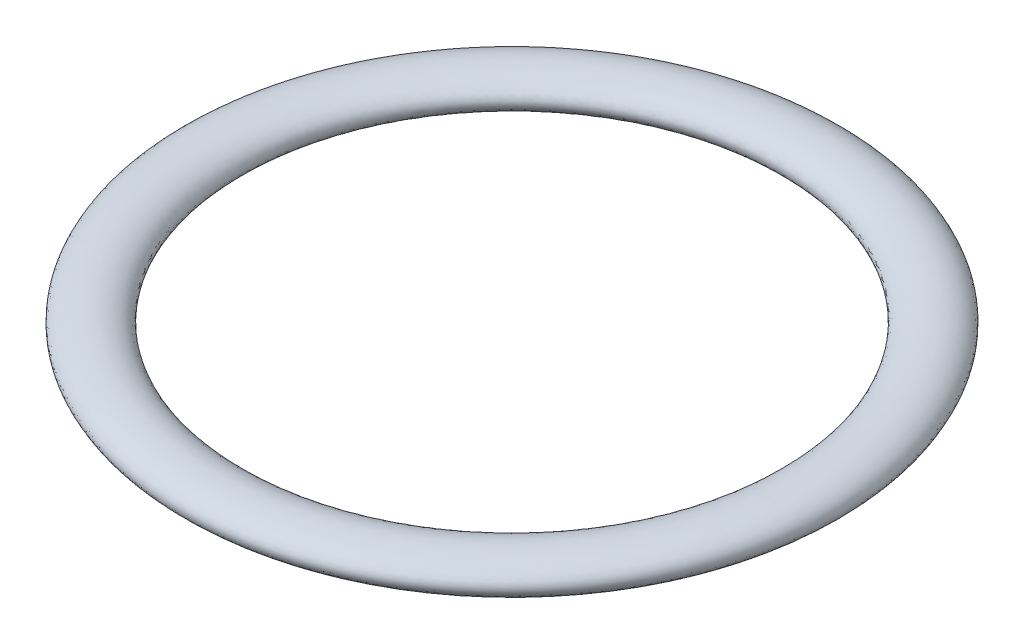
ISO-10303-21;
HEADER;
FILE_DESCRIPTION(('STEP AP214'),'2;1');
FILE_NAME('part.step','',(''),(''),'','','');
FILE_SCHEMA(('AUTOMOTIVE_DESIGN { 1 0 10303 214 1 1 1 1 }'));
ENDSEC;
DATA;
#1=APPLICATION_CONTEXT('core data for automotive mechanical design processes');
#2=APPLICATION_PROTOCOL_DEFINITION('international standard','automotive_design',2000,#1);
#3=PRODUCT_CONTEXT('',#1,'mechanical');
#4=PRODUCT('Part','Part','',(#3));
#5=PRODUCT_RELATED_PRODUCT_CATEGORY('part','',(#4));
#6=PRODUCT_DEFINITION_FORMATION('','',#4);
#7=PRODUCT_DEFINITION_CONTEXT('part definition',#1,'design');
#8=PRODUCT_DEFINITION('design','',#6,#7);
#9=PRODUCT_DEFINITION_SHAPE('','',#8);
#10=(LENGTH_UNIT() NAMED_UNIT(*) SI_UNIT(.MILLI.,.METRE.));
#11=(NAMED_UNIT(*) PLANE_ANGLE_UNIT() SI_UNIT($,.RADIAN.));
#12=(NAMED_UNIT(*) SI_UNIT($,.STERADIAN.) SOLID_ANGLE_UNIT());
#13=UNCERTAINTY_MEASURE_WITH_UNIT(LENGTH_MEASURE(1.E-05),#10,'distance_accuracy_value','');
#14=(GEOMETRIC_REPRESENTATION_CONTEXT(3) GLOBAL_UNCERTAINTY_ASSIGNED_CONTEXT((#13)) GLOBAL_UNIT_ASSIGNED_CONTEXT((#10,
#11,#12)) REPRESENTATION_CONTEXT('',''));
#15=CARTESIAN_POINT('',(0.,0.,0.));
#16=DIRECTION('',(0.,0.,1.));
#17=DIRECTION('',(1.,0.,0.));
#18=AXIS2_PLACEMENT_3D('',#15,#16,#17);
#19=CARTESIAN_POINT('',(12.925,-9.725,0.));
#20=DIRECTION('',(0.,0.,1.));
#21=DIRECTION('',(1.,0.,0.));
#22=AXIS2_PLACEMENT_3D('',#19,#20,#21);
#23=ELLIPSE('',#22,1.379310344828,0.725);
#24=CARTESIAN_POINT('',(0.,0.,0.));
#25=DIRECTION('',(0.,-1.,0.));
#26=AXIS1_PLACEMENT('',#24,#25);
#27=SURFACE_OF_REVOLUTION('',#23,#26);
#28=CARTESIAN_POINT('',(12.925,-9.725,0.));
#29=DIRECTION('',(0.,0.,1.));
#30=DIRECTION('',(1.,0.,0.));
#31=AXIS2_PLACEMENT_3D('',#28,#29,#30);
#32=ELLIPSE('',#31,1.379310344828,0.725);
#33=CARTESIAN_POINT('',(14.304310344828,-9.725,0.));
#34=VERTEX_POINT('',#33);
#35=EDGE_CURVE('E23',#34,#34,#32,.T.);
#36=ORIENTED_EDGE('',*,*,#35,.F.);
#37=CARTESIAN_POINT('',(0.,-9.725,0.));
#38=DIRECTION('',(0.,1.,0.));
#39=DIRECTION('',(1.,0.,0.));
#40=AXIS2_PLACEMENT_3D('',#37,#38,#39);
#41=CIRCLE('',#40,14.304310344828);
#42=EDGE_CURVE('E10',#34,#34,#41,.T.);
#43=ORIENTED_EDGE('',*,*,#42,.T.);
#44=ORIENTED_EDGE('',*,*,#35,.T.);
#45=ORIENTED_EDGE('',*,*,#42,.F.);
#46=EDGE_LOOP('',(#36,#43,#44,#45));
#47=FACE_BOUND('',#46,.T.);
#48=ADVANCED_FACE('F16',(#47),#27,.F.);
#49=CLOSED_SHELL('',(#48));
#50=MANIFOLD_SOLID_BREP('B1',#49);
#51=ADVANCED_BREP_SHAPE_REPRESENTATION('',(#18,#50),#14);
#52=SHAPE_DEFINITION_REPRESENTATION(#9,#51);
ENDSEC;
END-ISO-10303-21;
